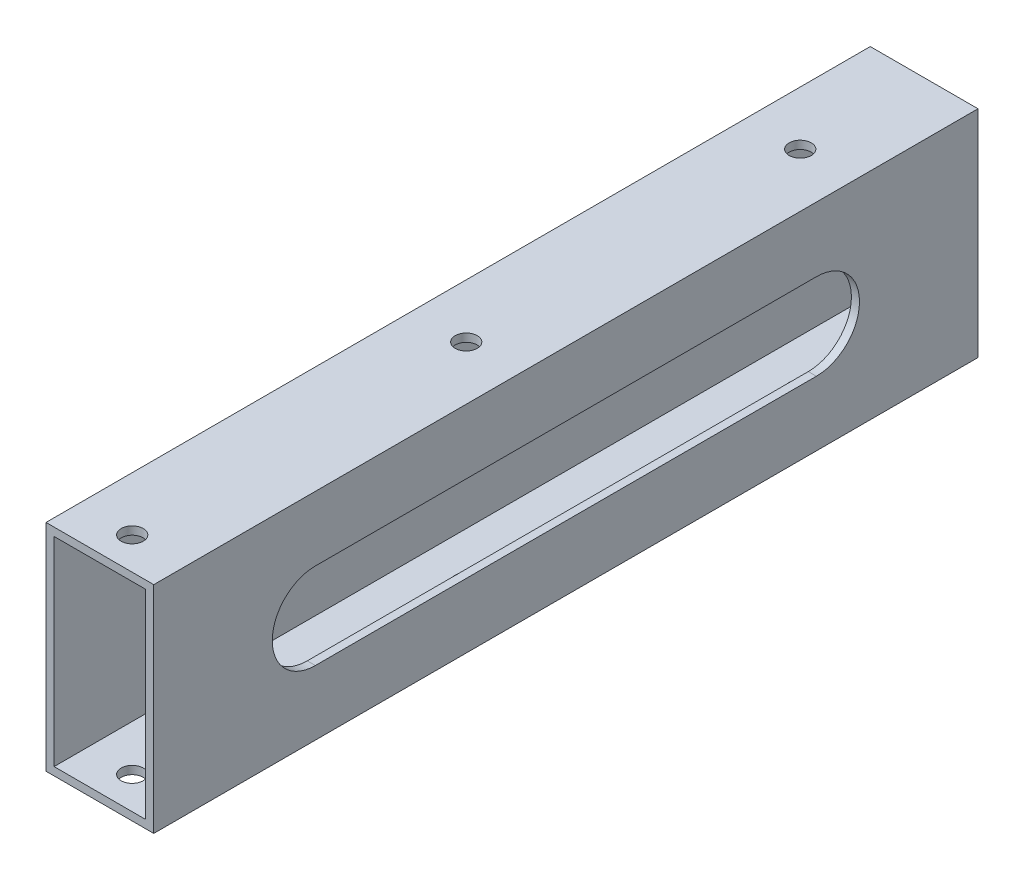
ISO-10303-21;
HEADER;
FILE_DESCRIPTION(('STEP AP214'),'2;1');
FILE_NAME('part.step','',(''),(''),'','','');
FILE_SCHEMA(('AUTOMOTIVE_DESIGN { 1 0 10303 214 1 1 1 1 }'));
ENDSEC;
DATA;
#1=APPLICATION_CONTEXT('core data for automotive mechanical design processes');
#2=APPLICATION_PROTOCOL_DEFINITION('international standard','automotive_design',2000,#1);
#3=PRODUCT_CONTEXT('',#1,'mechanical');
#4=PRODUCT('Part','Part','',(#3));
#5=PRODUCT_RELATED_PRODUCT_CATEGORY('part','',(#4));
#6=PRODUCT_DEFINITION_FORMATION('','',#4);
#7=PRODUCT_DEFINITION_CONTEXT('part definition',#1,'design');
#8=PRODUCT_DEFINITION('design','',#6,#7);
#9=PRODUCT_DEFINITION_SHAPE('','',#8);
#10=(LENGTH_UNIT() NAMED_UNIT(*) SI_UNIT(.MILLI.,.METRE.));
#11=(NAMED_UNIT(*) PLANE_ANGLE_UNIT() SI_UNIT($,.RADIAN.));
#12=(NAMED_UNIT(*) SI_UNIT($,.STERADIAN.) SOLID_ANGLE_UNIT());
#13=UNCERTAINTY_MEASURE_WITH_UNIT(LENGTH_MEASURE(1.E-05),#10,'distance_accuracy_value','');
#14=(GEOMETRIC_REPRESENTATION_CONTEXT(3) GLOBAL_UNCERTAINTY_ASSIGNED_CONTEXT((#13)) GLOBAL_UNIT_ASSIGNED_CONTEXT((#10,
#11,#12)) REPRESENTATION_CONTEXT('',''));
#15=CARTESIAN_POINT('',(0.,0.,0.));
#16=DIRECTION('',(0.,0.,1.));
#17=DIRECTION('',(1.,0.,0.));
#18=AXIS2_PLACEMENT_3D('',#15,#16,#17);
#19=CARTESIAN_POINT('',(0.,0.,0.));
#20=DIRECTION('',(0.,0.,-1.));
#21=DIRECTION('',(-1.,0.,0.));
#22=AXIS2_PLACEMENT_3D('',#19,#20,#21);
#23=PLANE('',#22);
#24=DIRECTION('',(0.,1.,0.));
#25=VECTOR('',#24,1.);
#26=CARTESIAN_POINT('',(10.,-20.,0.));
#27=LINE('',#26,#25);
#28=CARTESIAN_POINT('',(10.,-20.,0.));
#29=VERTEX_POINT('',#28);
#30=CARTESIAN_POINT('',(10.,20.,0.));
#31=VERTEX_POINT('',#30);
#32=EDGE_CURVE('E266',#29,#31,#27,.T.);
#33=ORIENTED_EDGE('',*,*,#32,.F.);
#34=DIRECTION('',(1.,0.,0.));
#35=VECTOR('',#34,1.);
#36=CARTESIAN_POINT('',(-10.,-20.,0.));
#37=LINE('',#36,#35);
#38=CARTESIAN_POINT('',(-10.,-20.,0.));
#39=VERTEX_POINT('',#38);
#40=EDGE_CURVE('E275',#39,#29,#37,.T.);
#41=ORIENTED_EDGE('',*,*,#40,.F.);
#42=DIRECTION('',(0.,-1.,0.));
#43=VECTOR('',#42,1.);
#44=CARTESIAN_POINT('',(-10.,-20.,0.));
#45=LINE('',#44,#43);
#46=CARTESIAN_POINT('',(-10.,20.,0.));
#47=VERTEX_POINT('',#46);
#48=EDGE_CURVE('E272',#47,#39,#45,.T.);
#49=ORIENTED_EDGE('',*,*,#48,.F.);
#50=DIRECTION('',(-1.,0.,0.));
#51=VECTOR('',#50,1.);
#52=CARTESIAN_POINT('',(-10.,20.,0.));
#53=LINE('',#52,#51);
#54=EDGE_CURVE('E269',#31,#47,#53,.T.);
#55=ORIENTED_EDGE('',*,*,#54,.F.);
#56=EDGE_LOOP('',(#33,#41,#49,#55));
#57=FACE_BOUND('',#56,.T.);
#58=DIRECTION('',(-1.,0.,0.));
#59=VECTOR('',#58,1.);
#60=CARTESIAN_POINT('',(-8.5,18.5,0.));
#61=LINE('',#60,#59);
#62=CARTESIAN_POINT('',(8.5,18.5,0.));
#63=VERTEX_POINT('',#62);
#64=CARTESIAN_POINT('',(-8.5,18.5,0.));
#65=VERTEX_POINT('',#64);
#66=EDGE_CURVE('E255',#63,#65,#61,.T.);
#67=ORIENTED_EDGE('',*,*,#66,.T.);
#68=DIRECTION('',(0.,-1.,0.));
#69=VECTOR('',#68,1.);
#70=CARTESIAN_POINT('',(-8.5,-18.5,0.));
#71=LINE('',#70,#69);
#72=CARTESIAN_POINT('',(-8.5,-18.5,0.));
#73=VERTEX_POINT('',#72);
#74=EDGE_CURVE('E246',#65,#73,#71,.T.);
#75=ORIENTED_EDGE('',*,*,#74,.T.);
#76=DIRECTION('',(1.,0.,0.));
#77=VECTOR('',#76,1.);
#78=CARTESIAN_POINT('',(-8.5,-18.5,0.));
#79=LINE('',#78,#77);
#80=CARTESIAN_POINT('',(8.5,-18.5,0.));
#81=VERTEX_POINT('',#80);
#82=EDGE_CURVE('E249',#73,#81,#79,.T.);
#83=ORIENTED_EDGE('',*,*,#82,.T.);
#84=DIRECTION('',(0.,1.,0.));
#85=VECTOR('',#84,1.);
#86=CARTESIAN_POINT('',(8.5,-18.5,0.));
#87=LINE('',#86,#85);
#88=EDGE_CURVE('E252',#81,#63,#87,.T.);
#89=ORIENTED_EDGE('',*,*,#88,.T.);
#90=EDGE_LOOP('',(#67,#75,#83,#89));
#91=FACE_BOUND('',#90,.T.);
#92=ADVANCED_FACE('F34',(#57,#91),#23,.T.);
#93=CARTESIAN_POINT('',(10.,-20.,170.));
#94=DIRECTION('',(-1.,0.,0.));
#95=DIRECTION('',(0.,0.,1.));
#96=AXIS2_PLACEMENT_3D('',#93,#94,#95);
#97=PLANE('',#96);
#98=DIRECTION('',(0.,0.,-1.));
#99=VECTOR('',#98,1.);
#100=CARTESIAN_POINT('',(10.,-8.,123.));
#101=LINE('',#100,#99);
#102=CARTESIAN_POINT('',(10.,-8.,123.));
#103=VERTEX_POINT('',#102);
#104=CARTESIAN_POINT('',(10.,-8.,30.));
#105=VERTEX_POINT('',#104);
#106=EDGE_CURVE('E161',#103,#105,#101,.T.);
#107=ORIENTED_EDGE('',*,*,#106,.F.);
#108=CARTESIAN_POINT('',(10.,0.,123.));
#109=DIRECTION('',(1.,0.,0.));
#110=DIRECTION('',(0.,0.,-1.));
#111=AXIS2_PLACEMENT_3D('',#108,#109,#110);
#112=CIRCLE('',#111,8.);
#113=CARTESIAN_POINT('',(10.,8.,123.));
#114=VERTEX_POINT('',#113);
#115=EDGE_CURVE('E49',#114,#103,#112,.T.);
#116=ORIENTED_EDGE('',*,*,#115,.F.);
#117=DIRECTION('',(0.,0.,1.));
#118=VECTOR('',#117,1.);
#119=CARTESIAN_POINT('',(10.,8.,123.));
#120=LINE('',#119,#118);
#121=CARTESIAN_POINT('',(10.,8.,30.));
#122=VERTEX_POINT('',#121);
#123=EDGE_CURVE('E168',#122,#114,#120,.T.);
#124=ORIENTED_EDGE('',*,*,#123,.F.);
#125=CARTESIAN_POINT('',(10.,0.,30.));
#126=DIRECTION('',(1.,0.,0.));
#127=DIRECTION('',(0.,0.,-1.));
#128=AXIS2_PLACEMENT_3D('',#125,#126,#127);
#129=CIRCLE('',#128,8.);
#130=EDGE_CURVE('E152',#105,#122,#129,.T.);
#131=ORIENTED_EDGE('',*,*,#130,.F.);
#132=EDGE_LOOP('',(#107,#116,#124,#131));
#133=FACE_BOUND('',#132,.T.);
#134=DIRECTION('',(0.,0.,-1.));
#135=VECTOR('',#134,1.);
#136=CARTESIAN_POINT('',(10.,20.,170.));
#137=LINE('',#136,#135);
#138=CARTESIAN_POINT('',(10.,20.,153.));
#139=VERTEX_POINT('',#138);
#140=EDGE_CURVE('E284',#139,#31,#137,.T.);
#141=ORIENTED_EDGE('',*,*,#140,.F.);
#142=DIRECTION('',(0.,1.,0.));
#143=VECTOR('',#142,1.);
#144=CARTESIAN_POINT('',(10.,20.,153.));
#145=LINE('',#144,#143);
#146=CARTESIAN_POINT('',(10.,-20.,153.));
#147=VERTEX_POINT('',#146);
#148=EDGE_CURVE('E202',#147,#139,#145,.T.);
#149=ORIENTED_EDGE('',*,*,#148,.F.);
#150=DIRECTION('',(0.,0.,-1.));
#151=VECTOR('',#150,1.);
#152=CARTESIAN_POINT('',(10.,-20.,170.));
#153=LINE('',#152,#151);
#154=EDGE_CURVE('E278',#147,#29,#153,.T.);
#155=ORIENTED_EDGE('',*,*,#154,.T.);
#156=ORIENTED_EDGE('',*,*,#32,.T.);
#157=EDGE_LOOP('',(#141,#149,#155,#156));
#158=FACE_BOUND('',#157,.T.);
#159=ADVANCED_FACE('F36',(#133,#158),#97,.F.);
#160=CARTESIAN_POINT('',(-10.,20.,170.));
#161=DIRECTION('',(0.,-1.,0.));
#162=DIRECTION('',(0.,0.,-1.));
#163=AXIS2_PLACEMENT_3D('',#160,#161,#162);
#164=PLANE('',#163);
#165=CARTESIAN_POINT('',(0.,20.,23.));
#166=DIRECTION('',(0.,1.,0.));
#167=DIRECTION('',(0.,0.,1.));
#168=AXIS2_PLACEMENT_3D('',#165,#166,#167);
#169=CIRCLE('',#168,2.05);
#170=CARTESIAN_POINT('',(0.,20.,25.05));
#171=VERTEX_POINT('',#170);
#172=EDGE_CURVE('E217',#171,#171,#169,.T.);
#173=ORIENTED_EDGE('',*,*,#172,.F.);
#174=EDGE_LOOP('',(#173));
#175=FACE_BOUND('',#174,.T.);
#176=CARTESIAN_POINT('',(0.,20.,85.));
#177=DIRECTION('',(0.,1.,0.));
#178=DIRECTION('',(0.,0.,1.));
#179=AXIS2_PLACEMENT_3D('',#176,#177,#178);
#180=CIRCLE('',#179,2.05);
#181=CARTESIAN_POINT('',(0.,20.,87.05));
#182=VERTEX_POINT('',#181);
#183=EDGE_CURVE('E216',#182,#182,#180,.T.);
#184=ORIENTED_EDGE('',*,*,#183,.F.);
#185=EDGE_LOOP('',(#184));
#186=FACE_BOUND('',#185,.T.);
#187=CARTESIAN_POINT('',(0.,20.,147.));
#188=DIRECTION('',(0.,1.,0.));
#189=DIRECTION('',(0.,0.,1.));
#190=AXIS2_PLACEMENT_3D('',#187,#188,#189);
#191=CIRCLE('',#190,2.05);
#192=CARTESIAN_POINT('',(0.,20.,149.05));
#193=VERTEX_POINT('',#192);
#194=EDGE_CURVE('E236',#193,#193,#191,.T.);
#195=ORIENTED_EDGE('',*,*,#194,.F.);
#196=EDGE_LOOP('',(#195));
#197=FACE_BOUND('',#196,.T.);
#198=DIRECTION('',(0.,0.,-1.));
#199=VECTOR('',#198,1.);
#200=CARTESIAN_POINT('',(-10.,20.,170.));
#201=LINE('',#200,#199);
#202=CARTESIAN_POINT('',(-10.,20.,153.));
#203=VERTEX_POINT('',#202);
#204=EDGE_CURVE('E282',#203,#47,#201,.T.);
#205=ORIENTED_EDGE('',*,*,#204,.F.);
#206=DIRECTION('',(-1.,0.,0.));
#207=VECTOR('',#206,1.);
#208=CARTESIAN_POINT('',(53.4626276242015,20.,153.));
#209=LINE('',#208,#207);
#210=EDGE_CURVE('E207',#139,#203,#209,.T.);
#211=ORIENTED_EDGE('',*,*,#210,.F.);
#212=ORIENTED_EDGE('',*,*,#140,.T.);
#213=ORIENTED_EDGE('',*,*,#54,.T.);
#214=EDGE_LOOP('',(#205,#211,#212,#213));
#215=FACE_BOUND('',#214,.T.);
#216=ADVANCED_FACE('F323',(#175,#186,#197,#215),#164,.F.);
#217=CARTESIAN_POINT('',(-10.,-20.,170.));
#218=DIRECTION('',(1.,0.,0.));
#219=DIRECTION('',(0.,0.,-1.));
#220=AXIS2_PLACEMENT_3D('',#217,#218,#219);
#221=PLANE('',#220);
#222=DIRECTION('',(0.,0.,1.));
#223=VECTOR('',#222,1.);
#224=CARTESIAN_POINT('',(-10.,8.,170.));
#225=LINE('',#224,#223);
#226=CARTESIAN_POINT('',(-10.,8.,30.));
#227=VERTEX_POINT('',#226);
#228=CARTESIAN_POINT('',(-10.,8.,123.));
#229=VERTEX_POINT('',#228);
#230=EDGE_CURVE('E192',#227,#229,#225,.T.);
#231=ORIENTED_EDGE('',*,*,#230,.T.);
#232=CARTESIAN_POINT('',(-10.,0.,123.));
#233=DIRECTION('',(1.,0.,0.));
#234=DIRECTION('',(0.,0.,-1.));
#235=AXIS2_PLACEMENT_3D('',#232,#233,#234);
#236=CIRCLE('',#235,8.);
#237=CARTESIAN_POINT('',(-10.,-8.,123.));
#238=VERTEX_POINT('',#237);
#239=EDGE_CURVE('E198',#229,#238,#236,.T.);
#240=ORIENTED_EDGE('',*,*,#239,.T.);
#241=DIRECTION('',(0.,0.,-1.));
#242=VECTOR('',#241,1.);
#243=CARTESIAN_POINT('',(-10.,-8.,170.));
#244=LINE('',#243,#242);
#245=CARTESIAN_POINT('',(-10.,-8.,30.));
#246=VERTEX_POINT('',#245);
#247=EDGE_CURVE('E182',#238,#246,#244,.T.);
#248=ORIENTED_EDGE('',*,*,#247,.T.);
#249=CARTESIAN_POINT('',(-10.,0.,30.));
#250=DIRECTION('',(1.,0.,0.));
#251=DIRECTION('',(0.,0.,-1.));
#252=AXIS2_PLACEMENT_3D('',#249,#250,#251);
#253=CIRCLE('',#252,8.);
#254=EDGE_CURVE('E187',#246,#227,#253,.T.);
#255=ORIENTED_EDGE('',*,*,#254,.T.);
#256=EDGE_LOOP('',(#231,#240,#248,#255));
#257=FACE_BOUND('',#256,.T.);
#258=DIRECTION('',(0.,0.,-1.));
#259=VECTOR('',#258,1.);
#260=CARTESIAN_POINT('',(-10.,-20.,170.));
#261=LINE('',#260,#259);
#262=CARTESIAN_POINT('',(-10.,-20.,153.));
#263=VERTEX_POINT('',#262);
#264=EDGE_CURVE('E280',#263,#39,#261,.T.);
#265=ORIENTED_EDGE('',*,*,#264,.F.);
#266=DIRECTION('',(0.,-1.,0.));
#267=VECTOR('',#266,1.);
#268=CARTESIAN_POINT('',(-10.,20.,153.));
#269=LINE('',#268,#267);
#270=EDGE_CURVE('E201',#203,#263,#269,.T.);
#271=ORIENTED_EDGE('',*,*,#270,.F.);
#272=ORIENTED_EDGE('',*,*,#204,.T.);
#273=ORIENTED_EDGE('',*,*,#48,.T.);
#274=EDGE_LOOP('',(#265,#271,#272,#273));
#275=FACE_BOUND('',#274,.T.);
#276=ADVANCED_FACE('F333',(#257,#275),#221,.F.);
#277=CARTESIAN_POINT('',(-10.,-20.,170.));
#278=DIRECTION('',(0.,1.,0.));
#279=DIRECTION('',(0.,0.,1.));
#280=AXIS2_PLACEMENT_3D('',#277,#278,#279);
#281=PLANE('',#280);
#282=CARTESIAN_POINT('',(0.,-20.,23.));
#283=DIRECTION('',(0.,1.,0.));
#284=DIRECTION('',(0.,0.,1.));
#285=AXIS2_PLACEMENT_3D('',#282,#283,#284);
#286=CIRCLE('',#285,2.05);
#287=CARTESIAN_POINT('',(0.,-20.,25.05));
#288=VERTEX_POINT('',#287);
#289=EDGE_CURVE('E233',#288,#288,#286,.T.);
#290=ORIENTED_EDGE('',*,*,#289,.T.);
#291=EDGE_LOOP('',(#290));
#292=FACE_BOUND('',#291,.T.);
#293=CARTESIAN_POINT('',(0.,-20.,85.));
#294=DIRECTION('',(0.,1.,0.));
#295=DIRECTION('',(0.,0.,1.));
#296=AXIS2_PLACEMENT_3D('',#293,#294,#295);
#297=CIRCLE('',#296,2.05);
#298=CARTESIAN_POINT('',(0.,-20.,87.05));
#299=VERTEX_POINT('',#298);
#300=EDGE_CURVE('E226',#299,#299,#297,.T.);
#301=ORIENTED_EDGE('',*,*,#300,.T.);
#302=EDGE_LOOP('',(#301));
#303=FACE_BOUND('',#302,.T.);
#304=CARTESIAN_POINT('',(0.,-20.,147.));
#305=DIRECTION('',(0.,1.,0.));
#306=DIRECTION('',(0.,0.,1.));
#307=AXIS2_PLACEMENT_3D('',#304,#305,#306);
#308=CIRCLE('',#307,2.05);
#309=CARTESIAN_POINT('',(0.,-20.,149.05));
#310=VERTEX_POINT('',#309);
#311=EDGE_CURVE('E243',#310,#310,#308,.T.);
#312=ORIENTED_EDGE('',*,*,#311,.T.);
#313=EDGE_LOOP('',(#312));
#314=FACE_BOUND('',#313,.T.);
#315=ORIENTED_EDGE('',*,*,#154,.F.);
#316=DIRECTION('',(-1.,0.,0.));
#317=VECTOR('',#316,1.);
#318=CARTESIAN_POINT('',(53.4626276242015,-20.,153.));
#319=LINE('',#318,#317);
#320=EDGE_CURVE('E205',#147,#263,#319,.T.);
#321=ORIENTED_EDGE('',*,*,#320,.T.);
#322=ORIENTED_EDGE('',*,*,#264,.T.);
#323=ORIENTED_EDGE('',*,*,#40,.T.);
#324=EDGE_LOOP('',(#315,#321,#322,#323));
#325=FACE_BOUND('',#324,.T.);
#326=ADVANCED_FACE('F330',(#292,#303,#314,#325),#281,.F.);
#327=CARTESIAN_POINT('',(-8.5,-18.5,170.));
#328=DIRECTION('',(1.,0.,0.));
#329=DIRECTION('',(0.,0.,-1.));
#330=AXIS2_PLACEMENT_3D('',#327,#328,#329);
#331=PLANE('',#330);
#332=CARTESIAN_POINT('',(-8.5,0.,123.));
#333=DIRECTION('',(1.,0.,0.));
#334=DIRECTION('',(0.,0.,-1.));
#335=AXIS2_PLACEMENT_3D('',#332,#333,#334);
#336=CIRCLE('',#335,8.);
#337=CARTESIAN_POINT('',(-8.5,8.,123.));
#338=VERTEX_POINT('',#337);
#339=CARTESIAN_POINT('',(-8.5,-8.,123.));
#340=VERTEX_POINT('',#339);
#341=EDGE_CURVE('E195',#338,#340,#336,.T.);
#342=ORIENTED_EDGE('',*,*,#341,.F.);
#343=DIRECTION('',(0.,0.,1.));
#344=VECTOR('',#343,1.);
#345=CARTESIAN_POINT('',(-8.5,8.,170.));
#346=LINE('',#345,#344);
#347=CARTESIAN_POINT('',(-8.5,8.,30.));
#348=VERTEX_POINT('',#347);
#349=EDGE_CURVE('E190',#348,#338,#346,.T.);
#350=ORIENTED_EDGE('',*,*,#349,.F.);
#351=CARTESIAN_POINT('',(-8.5,0.,30.));
#352=DIRECTION('',(1.,0.,0.));
#353=DIRECTION('',(0.,0.,-1.));
#354=AXIS2_PLACEMENT_3D('',#351,#352,#353);
#355=CIRCLE('',#354,8.);
#356=CARTESIAN_POINT('',(-8.5,-8.,30.));
#357=VERTEX_POINT('',#356);
#358=EDGE_CURVE('E185',#357,#348,#355,.T.);
#359=ORIENTED_EDGE('',*,*,#358,.F.);
#360=DIRECTION('',(0.,0.,-1.));
#361=VECTOR('',#360,1.);
#362=CARTESIAN_POINT('',(-8.5,-8.,170.));
#363=LINE('',#362,#361);
#364=EDGE_CURVE('E180',#340,#357,#363,.T.);
#365=ORIENTED_EDGE('',*,*,#364,.F.);
#366=EDGE_LOOP('',(#342,#350,#359,#365));
#367=FACE_BOUND('',#366,.T.);
#368=DIRECTION('',(0.,1.,0.));
#369=VECTOR('',#368,1.);
#370=CARTESIAN_POINT('',(-8.5,-18.5,153.));
#371=LINE('',#370,#369);
#372=CARTESIAN_POINT('',(-8.5,-18.5,153.));
#373=VERTEX_POINT('',#372);
#374=CARTESIAN_POINT('',(-8.5,18.5,153.));
#375=VERTEX_POINT('',#374);
#376=EDGE_CURVE('E214',#373,#375,#371,.T.);
#377=ORIENTED_EDGE('',*,*,#376,.F.);
#378=DIRECTION('',(0.,0.,-1.));
#379=VECTOR('',#378,1.);
#380=CARTESIAN_POINT('',(-8.5,-18.5,170.));
#381=LINE('',#380,#379);
#382=EDGE_CURVE('E264',#373,#73,#381,.T.);
#383=ORIENTED_EDGE('',*,*,#382,.T.);
#384=ORIENTED_EDGE('',*,*,#74,.F.);
#385=DIRECTION('',(0.,0.,-1.));
#386=VECTOR('',#385,1.);
#387=CARTESIAN_POINT('',(-8.5,18.5,170.));
#388=LINE('',#387,#386);
#389=EDGE_CURVE('E258',#375,#65,#388,.T.);
#390=ORIENTED_EDGE('',*,*,#389,.F.);
#391=EDGE_LOOP('',(#377,#383,#384,#390));
#392=FACE_BOUND('',#391,.T.);
#393=ADVANCED_FACE('F328',(#367,#392),#331,.T.);
#394=CARTESIAN_POINT('',(-8.5,-18.5,170.));
#395=DIRECTION('',(0.,1.,0.));
#396=DIRECTION('',(0.,0.,1.));
#397=AXIS2_PLACEMENT_3D('',#394,#395,#396);
#398=PLANE('',#397);
#399=DIRECTION('',(-1.,0.,0.));
#400=VECTOR('',#399,1.);
#401=CARTESIAN_POINT('',(-8.5,-18.5,153.));
#402=LINE('',#401,#400);
#403=CARTESIAN_POINT('',(8.5,-18.5,153.));
#404=VERTEX_POINT('',#403);
#405=EDGE_CURVE('E212',#404,#373,#402,.T.);
#406=ORIENTED_EDGE('',*,*,#405,.F.);
#407=DIRECTION('',(0.,0.,-1.));
#408=VECTOR('',#407,1.);
#409=CARTESIAN_POINT('',(8.5,-18.5,170.));
#410=LINE('',#409,#408);
#411=EDGE_CURVE('E262',#404,#81,#410,.T.);
#412=ORIENTED_EDGE('',*,*,#411,.T.);
#413=ORIENTED_EDGE('',*,*,#82,.F.);
#414=ORIENTED_EDGE('',*,*,#382,.F.);
#415=EDGE_LOOP('',(#406,#412,#413,#414));
#416=FACE_BOUND('',#415,.T.);
#417=CARTESIAN_POINT('',(0.,-18.5,23.));
#418=DIRECTION('',(0.,1.,0.));
#419=DIRECTION('',(0.,0.,1.));
#420=AXIS2_PLACEMENT_3D('',#417,#418,#419);
#421=CIRCLE('',#420,2.05);
#422=CARTESIAN_POINT('',(0.,-18.5,25.05));
#423=VERTEX_POINT('',#422);
#424=EDGE_CURVE('E230',#423,#423,#421,.T.);
#425=ORIENTED_EDGE('',*,*,#424,.F.);
#426=EDGE_LOOP('',(#425));
#427=FACE_BOUND('',#426,.T.);
#428=CARTESIAN_POINT('',(0.,-18.5,85.));
#429=DIRECTION('',(0.,1.,0.));
#430=DIRECTION('',(0.,0.,1.));
#431=AXIS2_PLACEMENT_3D('',#428,#429,#430);
#432=CIRCLE('',#431,2.05);
#433=CARTESIAN_POINT('',(0.,-18.5,87.05));
#434=VERTEX_POINT('',#433);
#435=EDGE_CURVE('E223',#434,#434,#432,.T.);
#436=ORIENTED_EDGE('',*,*,#435,.F.);
#437=EDGE_LOOP('',(#436));
#438=FACE_BOUND('',#437,.T.);
#439=CARTESIAN_POINT('',(0.,-18.5,147.));
#440=DIRECTION('',(0.,1.,0.));
#441=DIRECTION('',(0.,0.,1.));
#442=AXIS2_PLACEMENT_3D('',#439,#440,#441);
#443=CIRCLE('',#442,2.05);
#444=CARTESIAN_POINT('',(0.,-18.5,149.05));
#445=VERTEX_POINT('',#444);
#446=EDGE_CURVE('E240',#445,#445,#443,.T.);
#447=ORIENTED_EDGE('',*,*,#446,.F.);
#448=EDGE_LOOP('',(#447));
#449=FACE_BOUND('',#448,.T.);
#450=ADVANCED_FACE('F390',(#416,#427,#438,#449),#398,.T.);
#451=CARTESIAN_POINT('',(8.5,-18.5,170.));
#452=DIRECTION('',(-1.,0.,0.));
#453=DIRECTION('',(0.,-1.,0.));
#454=AXIS2_PLACEMENT_3D('',#451,#452,#453);
#455=PLANE('',#454);
#456=CARTESIAN_POINT('',(8.5,0.,123.));
#457=DIRECTION('',(-1.,0.,0.));
#458=DIRECTION('',(0.,-1.,0.));
#459=AXIS2_PLACEMENT_3D('',#456,#457,#458);
#460=CIRCLE('',#459,8.);
#461=CARTESIAN_POINT('',(8.5,-8.,123.));
#462=VERTEX_POINT('',#461);
#463=CARTESIAN_POINT('',(8.5,8.,123.));
#464=VERTEX_POINT('',#463);
#465=EDGE_CURVE('E11',#462,#464,#460,.T.);
#466=ORIENTED_EDGE('',*,*,#465,.F.);
#467=DIRECTION('',(0.,0.,1.));
#468=VECTOR('',#467,1.);
#469=CARTESIAN_POINT('',(8.5,-8.,170.));
#470=LINE('',#469,#468);
#471=CARTESIAN_POINT('',(8.5,-8.,30.));
#472=VERTEX_POINT('',#471);
#473=EDGE_CURVE('E294',#472,#462,#470,.T.);
#474=ORIENTED_EDGE('',*,*,#473,.F.);
#475=CARTESIAN_POINT('',(8.5,0.,30.));
#476=DIRECTION('',(-1.,0.,0.));
#477=DIRECTION('',(0.,-1.,0.));
#478=AXIS2_PLACEMENT_3D('',#475,#476,#477);
#479=CIRCLE('',#478,8.);
#480=CARTESIAN_POINT('',(8.5,8.,30.));
#481=VERTEX_POINT('',#480);
#482=EDGE_CURVE('E155',#481,#472,#479,.T.);
#483=ORIENTED_EDGE('',*,*,#482,.F.);
#484=DIRECTION('',(0.,0.,-1.));
#485=VECTOR('',#484,1.);
#486=CARTESIAN_POINT('',(8.5,8.,170.));
#487=LINE('',#486,#485);
#488=EDGE_CURVE('E42',#464,#481,#487,.T.);
#489=ORIENTED_EDGE('',*,*,#488,.F.);
#490=EDGE_LOOP('',(#466,#474,#483,#489));
#491=FACE_BOUND('',#490,.T.);
#492=DIRECTION('',(0.,-1.,0.));
#493=VECTOR('',#492,1.);
#494=CARTESIAN_POINT('',(8.5,-18.5,153.));
#495=LINE('',#494,#493);
#496=CARTESIAN_POINT('',(8.5,18.5,153.));
#497=VERTEX_POINT('',#496);
#498=EDGE_CURVE('E204',#497,#404,#495,.T.);
#499=ORIENTED_EDGE('',*,*,#498,.F.);
#500=DIRECTION('',(0.,0.,-1.));
#501=VECTOR('',#500,1.);
#502=CARTESIAN_POINT('',(8.5,18.5,170.));
#503=LINE('',#502,#501);
#504=EDGE_CURVE('E260',#497,#63,#503,.T.);
#505=ORIENTED_EDGE('',*,*,#504,.T.);
#506=ORIENTED_EDGE('',*,*,#88,.F.);
#507=ORIENTED_EDGE('',*,*,#411,.F.);
#508=EDGE_LOOP('',(#499,#505,#506,#507));
#509=FACE_BOUND('',#508,.T.);
#510=ADVANCED_FACE('F302',(#491,#509),#455,.T.);
#511=CARTESIAN_POINT('',(-8.5,18.5,170.));
#512=DIRECTION('',(0.,-1.,0.));
#513=DIRECTION('',(0.,0.,-1.));
#514=AXIS2_PLACEMENT_3D('',#511,#512,#513);
#515=PLANE('',#514);
#516=DIRECTION('',(1.,0.,0.));
#517=VECTOR('',#516,1.);
#518=CARTESIAN_POINT('',(-8.5,18.5,153.));
#519=LINE('',#518,#517);
#520=EDGE_CURVE('E286',#375,#497,#519,.T.);
#521=ORIENTED_EDGE('',*,*,#520,.F.);
#522=ORIENTED_EDGE('',*,*,#389,.T.);
#523=ORIENTED_EDGE('',*,*,#66,.F.);
#524=ORIENTED_EDGE('',*,*,#504,.F.);
#525=EDGE_LOOP('',(#521,#522,#523,#524));
#526=FACE_BOUND('',#525,.T.);
#527=CARTESIAN_POINT('',(0.,18.5,23.));
#528=DIRECTION('',(0.,-1.,0.));
#529=DIRECTION('',(0.,0.,-1.));
#530=AXIS2_PLACEMENT_3D('',#527,#528,#529);
#531=CIRCLE('',#530,2.05);
#532=CARTESIAN_POINT('',(0.,18.5,20.95));
#533=VERTEX_POINT('',#532);
#534=EDGE_CURVE('E229',#533,#533,#531,.T.);
#535=ORIENTED_EDGE('',*,*,#534,.F.);
#536=EDGE_LOOP('',(#535));
#537=FACE_BOUND('',#536,.T.);
#538=CARTESIAN_POINT('',(0.,18.5,85.));
#539=DIRECTION('',(0.,-1.,0.));
#540=DIRECTION('',(0.,0.,-1.));
#541=AXIS2_PLACEMENT_3D('',#538,#539,#540);
#542=CIRCLE('',#541,2.05);
#543=CARTESIAN_POINT('',(0.,18.5,82.95));
#544=VERTEX_POINT('',#543);
#545=EDGE_CURVE('E220',#544,#544,#542,.T.);
#546=ORIENTED_EDGE('',*,*,#545,.F.);
#547=EDGE_LOOP('',(#546));
#548=FACE_BOUND('',#547,.T.);
#549=CARTESIAN_POINT('',(0.,18.5,147.));
#550=DIRECTION('',(0.,-1.,0.));
#551=DIRECTION('',(0.,0.,-1.));
#552=AXIS2_PLACEMENT_3D('',#549,#550,#551);
#553=CIRCLE('',#552,2.05);
#554=CARTESIAN_POINT('',(0.,18.5,144.95));
#555=VERTEX_POINT('',#554);
#556=EDGE_CURVE('E239',#555,#555,#553,.T.);
#557=ORIENTED_EDGE('',*,*,#556,.F.);
#558=EDGE_LOOP('',(#557));
#559=FACE_BOUND('',#558,.T.);
#560=ADVANCED_FACE('F384',(#526,#537,#548,#559),#515,.T.);
#561=CARTESIAN_POINT('',(0.,-200.,147.));
#562=DIRECTION('',(0.,1.,0.));
#563=DIRECTION('',(0.,0.,1.));
#564=AXIS2_PLACEMENT_3D('',#561,#562,#563);
#565=CYLINDRICAL_SURFACE('',#564,2.05);
#566=ORIENTED_EDGE('',*,*,#556,.T.);
#567=EDGE_LOOP('',(#566));
#568=FACE_BOUND('',#567,.T.);
#569=ORIENTED_EDGE('',*,*,#194,.T.);
#570=EDGE_LOOP('',(#569));
#571=FACE_BOUND('',#570,.T.);
#572=ADVANCED_FACE('F381',(#568,#571),#565,.F.);
#573=ORIENTED_EDGE('',*,*,#446,.T.);
#574=EDGE_LOOP('',(#573));
#575=FACE_BOUND('',#574,.T.);
#576=ORIENTED_EDGE('',*,*,#311,.F.);
#577=EDGE_LOOP('',(#576));
#578=FACE_BOUND('',#577,.T.);
#579=ADVANCED_FACE('F379',(#575,#578),#565,.F.);
#580=CARTESIAN_POINT('',(0.,-200.,85.));
#581=DIRECTION('',(0.,1.,0.));
#582=DIRECTION('',(0.,0.,1.));
#583=AXIS2_PLACEMENT_3D('',#580,#581,#582);
#584=CYLINDRICAL_SURFACE('',#583,2.05);
#585=ORIENTED_EDGE('',*,*,#545,.T.);
#586=EDGE_LOOP('',(#585));
#587=FACE_BOUND('',#586,.T.);
#588=ORIENTED_EDGE('',*,*,#183,.T.);
#589=EDGE_LOOP('',(#588));
#590=FACE_BOUND('',#589,.T.);
#591=ADVANCED_FACE('F375',(#587,#590),#584,.F.);
#592=CARTESIAN_POINT('',(0.,-200.,23.));
#593=DIRECTION('',(0.,1.,0.));
#594=DIRECTION('',(0.,0.,1.));
#595=AXIS2_PLACEMENT_3D('',#592,#593,#594);
#596=CYLINDRICAL_SURFACE('',#595,2.05);
#597=ORIENTED_EDGE('',*,*,#534,.T.);
#598=EDGE_LOOP('',(#597));
#599=FACE_BOUND('',#598,.T.);
#600=ORIENTED_EDGE('',*,*,#172,.T.);
#601=EDGE_LOOP('',(#600));
#602=FACE_BOUND('',#601,.T.);
#603=ADVANCED_FACE('F372',(#599,#602),#596,.F.);
#604=ORIENTED_EDGE('',*,*,#435,.T.);
#605=EDGE_LOOP('',(#604));
#606=FACE_BOUND('',#605,.T.);
#607=ORIENTED_EDGE('',*,*,#300,.F.);
#608=EDGE_LOOP('',(#607));
#609=FACE_BOUND('',#608,.T.);
#610=ADVANCED_FACE('F369',(#606,#609),#584,.F.);
#611=ORIENTED_EDGE('',*,*,#424,.T.);
#612=EDGE_LOOP('',(#611));
#613=FACE_BOUND('',#612,.T.);
#614=ORIENTED_EDGE('',*,*,#289,.F.);
#615=EDGE_LOOP('',(#614));
#616=FACE_BOUND('',#615,.T.);
#617=ADVANCED_FACE('F362',(#613,#616),#596,.F.);
#618=CARTESIAN_POINT('',(53.4626276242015,20.,153.));
#619=DIRECTION('',(0.,0.,-1.));
#620=DIRECTION('',(-1.,0.,0.));
#621=AXIS2_PLACEMENT_3D('',#618,#619,#620);
#622=PLANE('',#621);
#623=ORIENTED_EDGE('',*,*,#376,.T.);
#624=ORIENTED_EDGE('',*,*,#520,.T.);
#625=ORIENTED_EDGE('',*,*,#498,.T.);
#626=ORIENTED_EDGE('',*,*,#405,.T.);
#627=EDGE_LOOP('',(#623,#624,#625,#626));
#628=FACE_BOUND('',#627,.T.);
#629=ORIENTED_EDGE('',*,*,#148,.T.);
#630=ORIENTED_EDGE('',*,*,#210,.T.);
#631=ORIENTED_EDGE('',*,*,#270,.T.);
#632=ORIENTED_EDGE('',*,*,#320,.F.);
#633=EDGE_LOOP('',(#629,#630,#631,#632));
#634=FACE_BOUND('',#633,.T.);
#635=ADVANCED_FACE('F357',(#628,#634),#622,.F.);
#636=CARTESIAN_POINT('',(-49.,-8.,123.));
#637=DIRECTION('',(0.,-1.,0.));
#638=DIRECTION('',(0.,0.,-1.));
#639=AXIS2_PLACEMENT_3D('',#636,#637,#638);
#640=PLANE('',#639);
#641=ORIENTED_EDGE('',*,*,#473,.T.);
#642=DIRECTION('',(1.,0.,0.));
#643=VECTOR('',#642,1.);
#644=CARTESIAN_POINT('',(-49.,-8.,123.));
#645=LINE('',#644,#643);
#646=EDGE_CURVE('E163',#462,#103,#645,.T.);
#647=ORIENTED_EDGE('',*,*,#646,.T.);
#648=ORIENTED_EDGE('',*,*,#106,.T.);
#649=DIRECTION('',(1.,0.,0.));
#650=VECTOR('',#649,1.);
#651=CARTESIAN_POINT('',(-49.,-8.,30.));
#652=LINE('',#651,#650);
#653=EDGE_CURVE('E147',#472,#105,#652,.T.);
#654=ORIENTED_EDGE('',*,*,#653,.F.);
#655=EDGE_LOOP('',(#641,#647,#648,#654));
#656=FACE_BOUND('',#655,.T.);
#657=ADVANCED_FACE('F162',(#656),#640,.F.);
#658=CARTESIAN_POINT('',(-49.,0.,30.));
#659=DIRECTION('',(1.,0.,0.));
#660=DIRECTION('',(0.,0.,-1.));
#661=AXIS2_PLACEMENT_3D('',#658,#659,#660);
#662=CYLINDRICAL_SURFACE('',#661,8.);
#663=ORIENTED_EDGE('',*,*,#482,.T.);
#664=ORIENTED_EDGE('',*,*,#653,.T.);
#665=ORIENTED_EDGE('',*,*,#130,.T.);
#666=DIRECTION('',(1.,0.,0.));
#667=VECTOR('',#666,1.);
#668=CARTESIAN_POINT('',(-49.,8.,30.));
#669=LINE('',#668,#667);
#670=EDGE_CURVE('E177',#481,#122,#669,.T.);
#671=ORIENTED_EDGE('',*,*,#670,.F.);
#672=EDGE_LOOP('',(#663,#664,#665,#671));
#673=FACE_BOUND('',#672,.T.);
#674=ADVANCED_FACE('F149',(#673),#662,.F.);
#675=CARTESIAN_POINT('',(-49.,8.,123.));
#676=DIRECTION('',(0.,1.,0.));
#677=DIRECTION('',(0.,0.,1.));
#678=AXIS2_PLACEMENT_3D('',#675,#676,#677);
#679=PLANE('',#678);
#680=ORIENTED_EDGE('',*,*,#488,.T.);
#681=ORIENTED_EDGE('',*,*,#670,.T.);
#682=ORIENTED_EDGE('',*,*,#123,.T.);
#683=DIRECTION('',(1.,0.,0.));
#684=VECTOR('',#683,1.);
#685=CARTESIAN_POINT('',(-49.,8.,123.));
#686=LINE('',#685,#684);
#687=EDGE_CURVE('E173',#464,#114,#686,.T.);
#688=ORIENTED_EDGE('',*,*,#687,.F.);
#689=EDGE_LOOP('',(#680,#681,#682,#688));
#690=FACE_BOUND('',#689,.T.);
#691=ADVANCED_FACE('F299',(#690),#679,.F.);
#692=CARTESIAN_POINT('',(-49.,0.,123.));
#693=DIRECTION('',(1.,0.,0.));
#694=DIRECTION('',(0.,0.,-1.));
#695=AXIS2_PLACEMENT_3D('',#692,#693,#694);
#696=CYLINDRICAL_SURFACE('',#695,8.);
#697=ORIENTED_EDGE('',*,*,#465,.T.);
#698=ORIENTED_EDGE('',*,*,#687,.T.);
#699=ORIENTED_EDGE('',*,*,#115,.T.);
#700=ORIENTED_EDGE('',*,*,#646,.F.);
#701=EDGE_LOOP('',(#697,#698,#699,#700));
#702=FACE_BOUND('',#701,.T.);
#703=ADVANCED_FACE('F304',(#702),#696,.F.);
#704=EDGE_CURVE('E175',#229,#338,#686,.T.);
#705=ORIENTED_EDGE('',*,*,#704,.T.);
#706=ORIENTED_EDGE('',*,*,#341,.T.);
#707=EDGE_CURVE('E158',#238,#340,#645,.T.);
#708=ORIENTED_EDGE('',*,*,#707,.F.);
#709=ORIENTED_EDGE('',*,*,#239,.F.);
#710=EDGE_LOOP('',(#705,#706,#708,#709));
#711=FACE_BOUND('',#710,.T.);
#712=ADVANCED_FACE('F306',(#711),#696,.F.);
#713=EDGE_CURVE('E176',#227,#348,#669,.T.);
#714=ORIENTED_EDGE('',*,*,#713,.T.);
#715=ORIENTED_EDGE('',*,*,#349,.T.);
#716=ORIENTED_EDGE('',*,*,#704,.F.);
#717=ORIENTED_EDGE('',*,*,#230,.F.);
#718=EDGE_LOOP('',(#714,#715,#716,#717));
#719=FACE_BOUND('',#718,.T.);
#720=ADVANCED_FACE('F312',(#719),#679,.F.);
#721=EDGE_CURVE('E57',#246,#357,#652,.T.);
#722=ORIENTED_EDGE('',*,*,#721,.T.);
#723=ORIENTED_EDGE('',*,*,#358,.T.);
#724=ORIENTED_EDGE('',*,*,#713,.F.);
#725=ORIENTED_EDGE('',*,*,#254,.F.);
#726=EDGE_LOOP('',(#722,#723,#724,#725));
#727=FACE_BOUND('',#726,.T.);
#728=ADVANCED_FACE('F499',(#727),#662,.F.);
#729=ORIENTED_EDGE('',*,*,#707,.T.);
#730=ORIENTED_EDGE('',*,*,#364,.T.);
#731=ORIENTED_EDGE('',*,*,#721,.F.);
#732=ORIENTED_EDGE('',*,*,#247,.F.);
#733=EDGE_LOOP('',(#729,#730,#731,#732));
#734=FACE_BOUND('',#733,.T.);
#735=ADVANCED_FACE('F368',(#734),#640,.F.);
#736=CLOSED_SHELL('',(#92,#159,#216,#276,#326,#393,#450,#510,#560,#572,#579,#591,#603,#610,#617,
#635,#657,#674,#691,#703,#712,#720,#728,#735));
#737=MANIFOLD_SOLID_BREP('B2',#736);
#738=ADVANCED_BREP_SHAPE_REPRESENTATION('',(#18,#737),#14);
#739=SHAPE_DEFINITION_REPRESENTATION(#9,#738);
ENDSEC;
END-ISO-10303-21;
